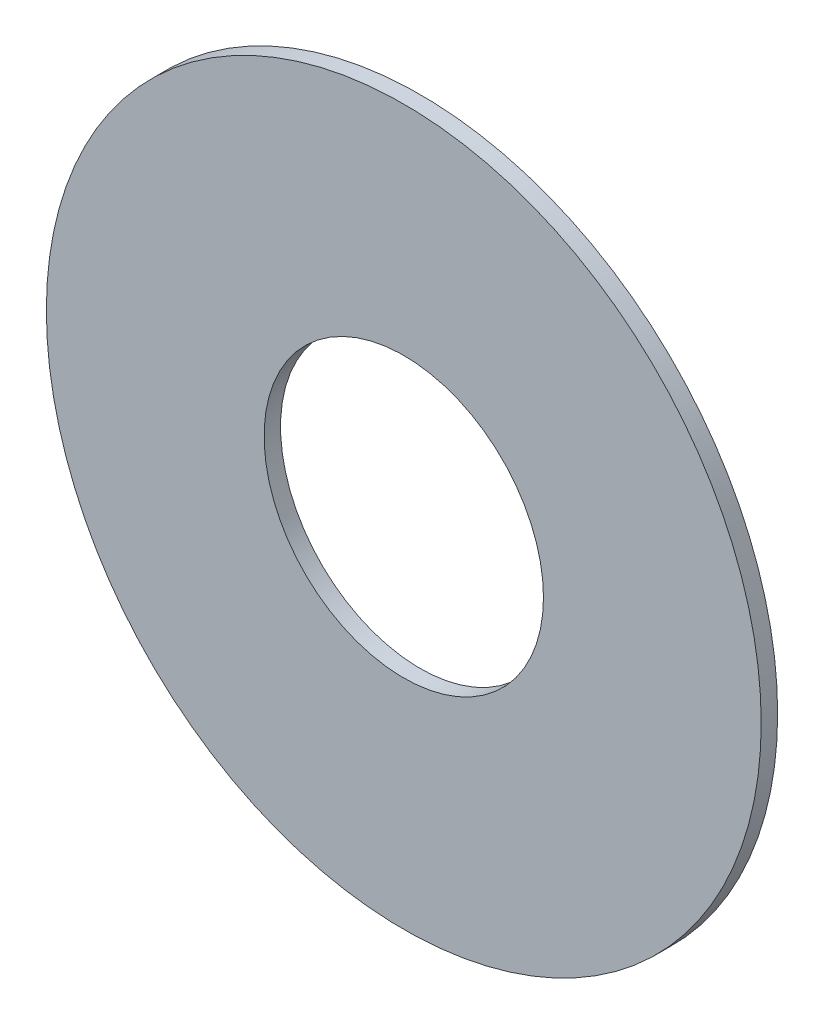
from build123d import *

# Parameters (mm, degrees)
SKETCH1_R           = 2175
SKETCH1_R_2         = 850
BOSS_EXTRUDE1_DEPTH = 100


with BuildPart() as part:
    # Sketch1 → Boss-Extrude1 (new body)
    with BuildSketch(Plane.XY):
        Circle(SKETCH1_R)
        Circle(SKETCH1_R_2, mode=Mode.SUBTRACT)
    extrude(amount=-BOSS_EXTRUDE1_DEPTH)


solid = part.part
